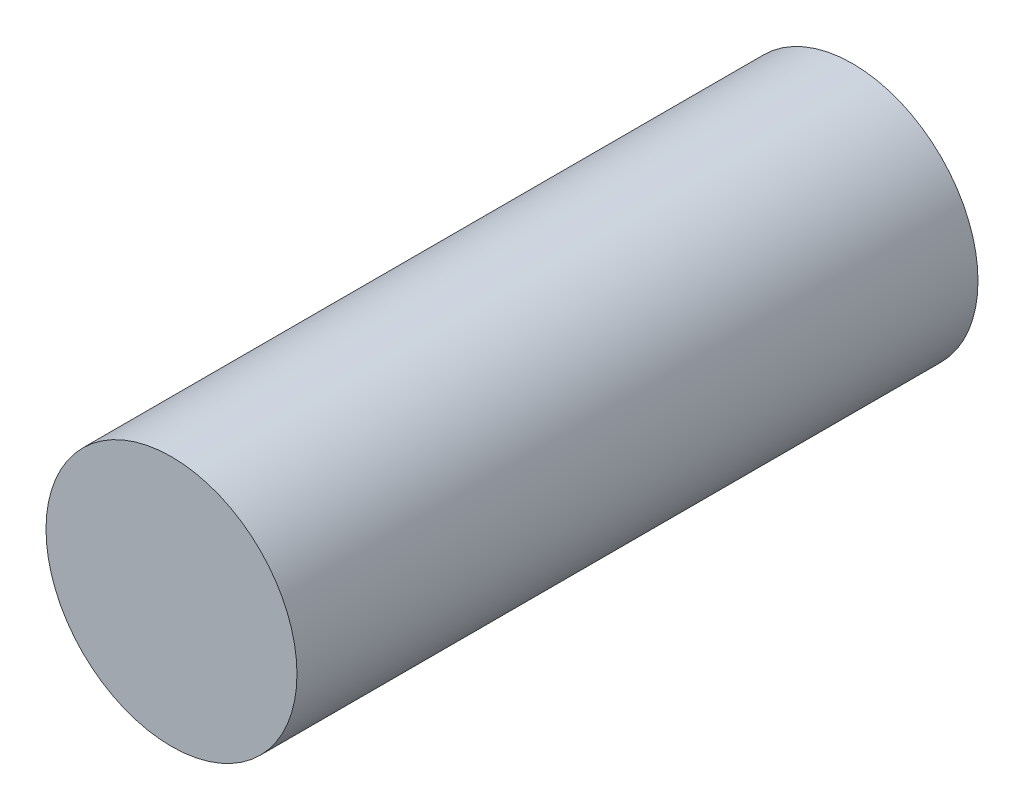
ISO-10303-21;
HEADER;
FILE_DESCRIPTION(('STEP AP214'),'2;1');
FILE_NAME('part.step','',(''),(''),'','','');
FILE_SCHEMA(('AUTOMOTIVE_DESIGN { 1 0 10303 214 1 1 1 1 }'));
ENDSEC;
DATA;
#1=APPLICATION_CONTEXT('core data for automotive mechanical design processes');
#2=APPLICATION_PROTOCOL_DEFINITION('international standard','automotive_design',2000,#1);
#3=PRODUCT_CONTEXT('',#1,'mechanical');
#4=PRODUCT('Part','Part','',(#3));
#5=PRODUCT_RELATED_PRODUCT_CATEGORY('part','',(#4));
#6=PRODUCT_DEFINITION_FORMATION('','',#4);
#7=PRODUCT_DEFINITION_CONTEXT('part definition',#1,'design');
#8=PRODUCT_DEFINITION('design','',#6,#7);
#9=PRODUCT_DEFINITION_SHAPE('','',#8);
#10=(LENGTH_UNIT() NAMED_UNIT(*) SI_UNIT(.MILLI.,.METRE.));
#11=(NAMED_UNIT(*) PLANE_ANGLE_UNIT() SI_UNIT($,.RADIAN.));
#12=(NAMED_UNIT(*) SI_UNIT($,.STERADIAN.) SOLID_ANGLE_UNIT());
#13=UNCERTAINTY_MEASURE_WITH_UNIT(LENGTH_MEASURE(1.E-05),#10,'distance_accuracy_value','');
#14=(GEOMETRIC_REPRESENTATION_CONTEXT(3) GLOBAL_UNCERTAINTY_ASSIGNED_CONTEXT((#13)) GLOBAL_UNIT_ASSIGNED_CONTEXT((#10,
#11,#12)) REPRESENTATION_CONTEXT('',''));
#15=CARTESIAN_POINT('',(0.,0.,0.));
#16=DIRECTION('',(0.,0.,1.));
#17=DIRECTION('',(1.,0.,0.));
#18=AXIS2_PLACEMENT_3D('',#15,#16,#17);
#19=CARTESIAN_POINT('',(-65.8067836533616,45.362648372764,570.));
#20=DIRECTION('',(0.,0.,-1.));
#21=DIRECTION('',(-1.,0.,0.));
#22=AXIS2_PLACEMENT_3D('',#19,#20,#21);
#23=CYLINDRICAL_SURFACE('',#22,105.029000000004);
#24=CARTESIAN_POINT('',(-65.8067836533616,45.362648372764,570.));
#25=DIRECTION('',(0.,0.,-1.));
#26=DIRECTION('',(-1.,0.,0.));
#27=AXIS2_PLACEMENT_3D('',#24,#25,#26);
#28=CIRCLE('',#27,105.029000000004);
#29=CARTESIAN_POINT('',(-170.835783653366,45.3626483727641,570.));
#30=VERTEX_POINT('',#29);
#31=EDGE_CURVE('E12',#30,#30,#28,.T.);
#32=ORIENTED_EDGE('',*,*,#31,.T.);
#33=EDGE_LOOP('',(#32));
#34=FACE_BOUND('',#33,.T.);
#35=CARTESIAN_POINT('',(-65.8067836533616,45.362648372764,0.));
#36=DIRECTION('',(0.,0.,-1.));
#37=DIRECTION('',(-1.,0.,0.));
#38=AXIS2_PLACEMENT_3D('',#35,#36,#37);
#39=CIRCLE('',#38,105.029000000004);
#40=CARTESIAN_POINT('',(-170.835783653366,45.3626483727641,0.));
#41=VERTEX_POINT('',#40);
#42=EDGE_CURVE('E46',#41,#41,#39,.T.);
#43=ORIENTED_EDGE('',*,*,#42,.F.);
#44=EDGE_LOOP('',(#43));
#45=FACE_BOUND('',#44,.T.);
#46=ADVANCED_FACE('F40',(#34,#45),#23,.T.);
#47=CARTESIAN_POINT('',(39.2222163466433,45.362648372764,570.));
#48=DIRECTION('',(0.,0.,1.));
#49=DIRECTION('',(1.,0.,0.));
#50=AXIS2_PLACEMENT_3D('',#47,#48,#49);
#51=PLANE('',#50);
#52=ORIENTED_EDGE('',*,*,#31,.F.);
#53=EDGE_LOOP('',(#52));
#54=FACE_BOUND('',#53,.T.);
#55=ADVANCED_FACE('F55',(#54),#51,.T.);
#56=CARTESIAN_POINT('',(-65.8067836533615,45.362648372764,0.));
#57=DIRECTION('',(0.,0.,-1.));
#58=DIRECTION('',(-1.,0.,0.));
#59=AXIS2_PLACEMENT_3D('',#56,#57,#58);
#60=PLANE('',#59);
#61=ORIENTED_EDGE('',*,*,#42,.T.);
#62=EDGE_LOOP('',(#61));
#63=FACE_BOUND('',#62,.T.);
#64=ADVANCED_FACE('F52',(#63),#60,.T.);
#65=CLOSED_SHELL('',(#46,#55,#64));
#66=MANIFOLD_SOLID_BREP('B2',#65);
#67=ADVANCED_BREP_SHAPE_REPRESENTATION('',(#18,#66),#14);
#68=SHAPE_DEFINITION_REPRESENTATION(#9,#67);
ENDSEC;
END-ISO-10303-21;
